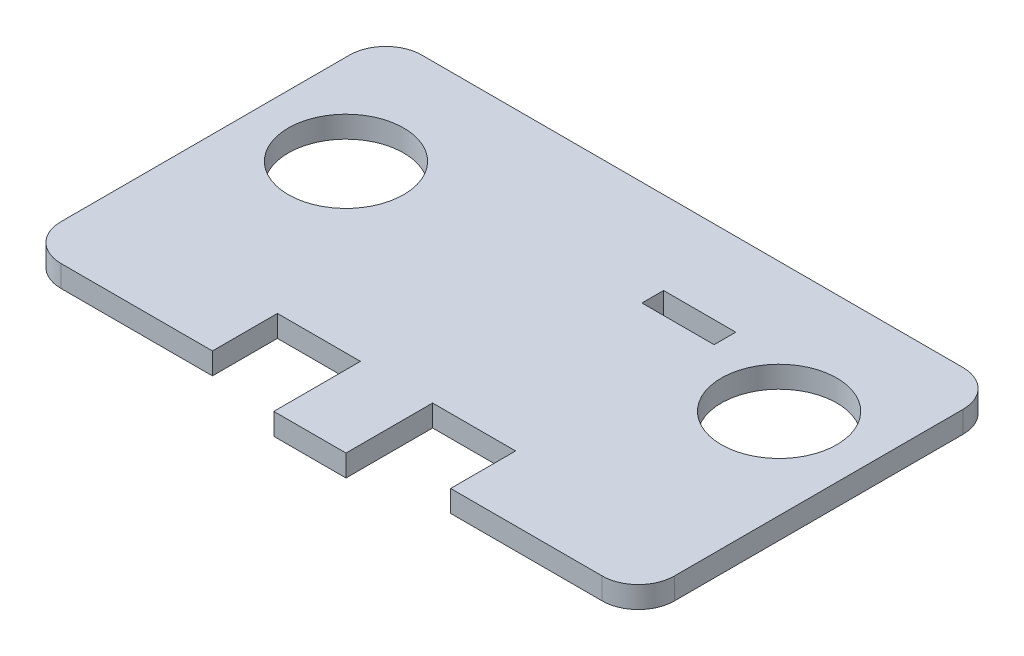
ISO-10303-21;
HEADER;
FILE_DESCRIPTION(('STEP AP214'),'2;1');
FILE_NAME('part.step','',(''),(''),'','','');
FILE_SCHEMA(('AUTOMOTIVE_DESIGN { 1 0 10303 214 1 1 1 1 }'));
ENDSEC;
DATA;
#1=APPLICATION_CONTEXT('core data for automotive mechanical design processes');
#2=APPLICATION_PROTOCOL_DEFINITION('international standard','automotive_design',2000,#1);
#3=PRODUCT_CONTEXT('',#1,'mechanical');
#4=PRODUCT('Part','Part','',(#3));
#5=PRODUCT_RELATED_PRODUCT_CATEGORY('part','',(#4));
#6=PRODUCT_DEFINITION_FORMATION('','',#4);
#7=PRODUCT_DEFINITION_CONTEXT('part definition',#1,'design');
#8=PRODUCT_DEFINITION('design','',#6,#7);
#9=PRODUCT_DEFINITION_SHAPE('','',#8);
#10=(LENGTH_UNIT() NAMED_UNIT(*) SI_UNIT(.MILLI.,.METRE.));
#11=(NAMED_UNIT(*) PLANE_ANGLE_UNIT() SI_UNIT($,.RADIAN.));
#12=(NAMED_UNIT(*) SI_UNIT($,.STERADIAN.) SOLID_ANGLE_UNIT());
#13=UNCERTAINTY_MEASURE_WITH_UNIT(LENGTH_MEASURE(1.E-05),#10,'distance_accuracy_value','');
#14=(GEOMETRIC_REPRESENTATION_CONTEXT(3) GLOBAL_UNCERTAINTY_ASSIGNED_CONTEXT((#13)) GLOBAL_UNIT_ASSIGNED_CONTEXT((#10,
#11,#12)) REPRESENTATION_CONTEXT('',''));
#15=CARTESIAN_POINT('',(0.,0.,0.));
#16=DIRECTION('',(0.,0.,1.));
#17=DIRECTION('',(1.,0.,0.));
#18=AXIS2_PLACEMENT_3D('',#15,#16,#17);
#19=CARTESIAN_POINT('',(0.,0.,16.));
#20=DIRECTION('',(0.,0.,-1.));
#21=DIRECTION('',(-1.,0.,0.));
#22=AXIS2_PLACEMENT_3D('',#19,#20,#21);
#23=PLANE('',#22);
#24=DIRECTION('',(0.,1.,0.));
#25=VECTOR('',#24,1.);
#26=CARTESIAN_POINT('',(5.,0.,16.));
#27=LINE('',#26,#25);
#28=CARTESIAN_POINT('',(5.,0.,16.));
#29=VERTEX_POINT('',#28);
#30=CARTESIAN_POINT('',(5.,3.,16.));
#31=VERTEX_POINT('',#30);
#32=EDGE_CURVE('E230',#29,#31,#27,.T.);
#33=ORIENTED_EDGE('',*,*,#32,.F.);
#34=DIRECTION('',(-1.,0.,0.));
#35=VECTOR('',#34,1.);
#36=CARTESIAN_POINT('',(0.,0.,16.));
#37=LINE('',#36,#35);
#38=CARTESIAN_POINT('',(16.5,0.,16.));
#39=VERTEX_POINT('',#38);
#40=EDGE_CURVE('E244',#39,#29,#37,.T.);
#41=ORIENTED_EDGE('',*,*,#40,.F.);
#42=DIRECTION('',(0.,1.,0.));
#43=VECTOR('',#42,1.);
#44=CARTESIAN_POINT('',(16.5,0.,16.));
#45=LINE('',#44,#43);
#46=CARTESIAN_POINT('',(16.5,3.,16.));
#47=VERTEX_POINT('',#46);
#48=EDGE_CURVE('E239',#39,#47,#45,.T.);
#49=ORIENTED_EDGE('',*,*,#48,.T.);
#50=DIRECTION('',(-1.,0.,0.));
#51=VECTOR('',#50,1.);
#52=CARTESIAN_POINT('',(0.,3.,16.));
#53=LINE('',#52,#51);
#54=EDGE_CURVE('E252',#47,#31,#53,.T.);
#55=ORIENTED_EDGE('',*,*,#54,.T.);
#56=EDGE_LOOP('',(#33,#41,#49,#55));
#57=FACE_BOUND('',#56,.T.);
#58=ADVANCED_FACE('F33',(#57),#23,.F.);
#59=CARTESIAN_POINT('',(-42.5,3.,25.));
#60=DIRECTION('',(0.,0.,-1.));
#61=DIRECTION('',(-1.,0.,0.));
#62=AXIS2_PLACEMENT_3D('',#59,#60,#61);
#63=PLANE('',#62);
#64=DIRECTION('',(0.,1.,0.));
#65=VECTOR('',#64,1.);
#66=CARTESIAN_POINT('',(16.5,0.,25.));
#67=LINE('',#66,#65);
#68=CARTESIAN_POINT('',(16.5,0.,25.));
#69=VERTEX_POINT('',#68);
#70=CARTESIAN_POINT('',(16.5,3.,25.));
#71=VERTEX_POINT('',#70);
#72=EDGE_CURVE('E236',#69,#71,#67,.T.);
#73=ORIENTED_EDGE('',*,*,#72,.F.);
#74=DIRECTION('',(1.,0.,0.));
#75=VECTOR('',#74,1.);
#76=CARTESIAN_POINT('',(-42.5,0.,25.));
#77=LINE('',#76,#75);
#78=CARTESIAN_POINT('',(37.5,0.,25.));
#79=VERTEX_POINT('',#78);
#80=EDGE_CURVE('E297',#69,#79,#77,.T.);
#81=ORIENTED_EDGE('',*,*,#80,.T.);
#82=DIRECTION('',(0.,-1.,0.));
#83=VECTOR('',#82,1.);
#84=CARTESIAN_POINT('',(37.5,3.,25.));
#85=LINE('',#84,#83);
#86=CARTESIAN_POINT('',(37.5,3.,25.));
#87=VERTEX_POINT('',#86);
#88=EDGE_CURVE('E11',#79,#87,#85,.F.);
#89=ORIENTED_EDGE('',*,*,#88,.T.);
#90=DIRECTION('',(1.,0.,0.));
#91=VECTOR('',#90,1.);
#92=CARTESIAN_POINT('',(-42.5,3.,25.));
#93=LINE('',#92,#91);
#94=EDGE_CURVE('E284',#71,#87,#93,.T.);
#95=ORIENTED_EDGE('',*,*,#94,.F.);
#96=EDGE_LOOP('',(#73,#81,#89,#95));
#97=FACE_BOUND('',#96,.T.);
#98=ADVANCED_FACE('F383',(#97),#63,.F.);
#99=CARTESIAN_POINT('',(0.,3.,0.));
#100=DIRECTION('',(0.,1.,0.));
#101=DIRECTION('',(0.,0.,1.));
#102=AXIS2_PLACEMENT_3D('',#99,#100,#101);
#103=PLANE('',#102);
#104=DIRECTION('',(0.,0.,-1.));
#105=VECTOR('',#104,1.);
#106=CARTESIAN_POINT('',(17.5,3.,-13.5));
#107=LINE('',#106,#105);
#108=CARTESIAN_POINT('',(17.5,3.,-10.5));
#109=VERTEX_POINT('',#108);
#110=CARTESIAN_POINT('',(17.5,3.,-13.5));
#111=VERTEX_POINT('',#110);
#112=EDGE_CURVE('E48',#109,#111,#107,.T.);
#113=ORIENTED_EDGE('',*,*,#112,.F.);
#114=DIRECTION('',(1.,0.,0.));
#115=VECTOR('',#114,1.);
#116=CARTESIAN_POINT('',(7.50000000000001,3.,-10.5));
#117=LINE('',#116,#115);
#118=CARTESIAN_POINT('',(7.50000000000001,3.,-10.5));
#119=VERTEX_POINT('',#118);
#120=EDGE_CURVE('E188',#119,#109,#117,.T.);
#121=ORIENTED_EDGE('',*,*,#120,.F.);
#122=DIRECTION('',(0.,0.,1.));
#123=VECTOR('',#122,1.);
#124=CARTESIAN_POINT('',(7.50000000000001,3.,-13.5));
#125=LINE('',#124,#123);
#126=CARTESIAN_POINT('',(7.50000000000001,3.,-13.5));
#127=VERTEX_POINT('',#126);
#128=EDGE_CURVE('E191',#127,#119,#125,.T.);
#129=ORIENTED_EDGE('',*,*,#128,.F.);
#130=DIRECTION('',(-1.,0.,0.));
#131=VECTOR('',#130,1.);
#132=CARTESIAN_POINT('',(7.50000000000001,3.,-13.5));
#133=LINE('',#132,#131);
#134=EDGE_CURVE('E197',#111,#127,#133,.T.);
#135=ORIENTED_EDGE('',*,*,#134,.F.);
#136=EDGE_LOOP('',(#113,#121,#129,#135));
#137=FACE_BOUND('',#136,.T.);
#138=CARTESIAN_POINT('',(-30.,3.,-7.00000000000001));
#139=DIRECTION('',(0.,1.,0.));
#140=DIRECTION('',(0.,0.,1.));
#141=AXIS2_PLACEMENT_3D('',#138,#139,#140);
#142=CIRCLE('',#141,8.);
#143=CARTESIAN_POINT('',(-30.,3.,0.999999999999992));
#144=VERTEX_POINT('',#143);
#145=EDGE_CURVE('E265',#144,#144,#142,.T.);
#146=ORIENTED_EDGE('',*,*,#145,.F.);
#147=EDGE_LOOP('',(#146));
#148=FACE_BOUND('',#147,.T.);
#149=CARTESIAN_POINT('',(30.,3.,-7.00000000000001));
#150=DIRECTION('',(0.,1.,0.));
#151=DIRECTION('',(0.,0.,1.));
#152=AXIS2_PLACEMENT_3D('',#149,#150,#151);
#153=CIRCLE('',#152,8.);
#154=CARTESIAN_POINT('',(30.,3.,0.999999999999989));
#155=VERTEX_POINT('',#154);
#156=EDGE_CURVE('E259',#155,#155,#153,.T.);
#157=ORIENTED_EDGE('',*,*,#156,.F.);
#158=EDGE_LOOP('',(#157));
#159=FACE_BOUND('',#158,.T.);
#160=ORIENTED_EDGE('',*,*,#54,.F.);
#161=DIRECTION('',(0.,0.,1.));
#162=VECTOR('',#161,1.);
#163=CARTESIAN_POINT('',(16.5,3.,25.));
#164=LINE('',#163,#162);
#165=EDGE_CURVE('E233',#47,#71,#164,.T.);
#166=ORIENTED_EDGE('',*,*,#165,.T.);
#167=ORIENTED_EDGE('',*,*,#94,.T.);
#168=CARTESIAN_POINT('',(37.5,3.,20.));
#169=DIRECTION('',(0.,1.,0.));
#170=DIRECTION('',(0.,0.,1.));
#171=AXIS2_PLACEMENT_3D('',#168,#169,#170);
#172=CIRCLE('',#171,5.);
#173=CARTESIAN_POINT('',(42.5,3.,20.));
#174=VERTEX_POINT('',#173);
#175=EDGE_CURVE('E320',#87,#174,#172,.T.);
#176=ORIENTED_EDGE('',*,*,#175,.T.);
#177=DIRECTION('',(0.,0.,-1.));
#178=VECTOR('',#177,1.);
#179=CARTESIAN_POINT('',(42.5,3.,-25.));
#180=LINE('',#179,#178);
#181=CARTESIAN_POINT('',(42.5,3.,-20.));
#182=VERTEX_POINT('',#181);
#183=EDGE_CURVE('E274',#174,#182,#180,.T.);
#184=ORIENTED_EDGE('',*,*,#183,.T.);
#185=CARTESIAN_POINT('',(37.5,3.,-20.));
#186=DIRECTION('',(0.,1.,0.));
#187=DIRECTION('',(0.,0.,1.));
#188=AXIS2_PLACEMENT_3D('',#185,#186,#187);
#189=CIRCLE('',#188,5.);
#190=CARTESIAN_POINT('',(37.5,3.,-25.));
#191=VERTEX_POINT('',#190);
#192=EDGE_CURVE('E322',#182,#191,#189,.T.);
#193=ORIENTED_EDGE('',*,*,#192,.T.);
#194=DIRECTION('',(-1.,0.,0.));
#195=VECTOR('',#194,1.);
#196=CARTESIAN_POINT('',(-42.5,3.,-25.));
#197=LINE('',#196,#195);
#198=CARTESIAN_POINT('',(-37.5,3.,-25.));
#199=VERTEX_POINT('',#198);
#200=EDGE_CURVE('E277',#191,#199,#197,.T.);
#201=ORIENTED_EDGE('',*,*,#200,.T.);
#202=CARTESIAN_POINT('',(-37.5,3.,-20.));
#203=DIRECTION('',(0.,1.,0.));
#204=DIRECTION('',(0.,0.,1.));
#205=AXIS2_PLACEMENT_3D('',#202,#203,#204);
#206=CIRCLE('',#205,5.);
#207=CARTESIAN_POINT('',(-42.5,3.,-20.));
#208=VERTEX_POINT('',#207);
#209=EDGE_CURVE('E324',#199,#208,#206,.T.);
#210=ORIENTED_EDGE('',*,*,#209,.T.);
#211=DIRECTION('',(0.,0.,1.));
#212=VECTOR('',#211,1.);
#213=CARTESIAN_POINT('',(-42.5,3.,-25.));
#214=LINE('',#213,#212);
#215=CARTESIAN_POINT('',(-42.5,3.,20.));
#216=VERTEX_POINT('',#215);
#217=EDGE_CURVE('E281',#208,#216,#214,.T.);
#218=ORIENTED_EDGE('',*,*,#217,.T.);
#219=CARTESIAN_POINT('',(-37.5,3.,20.));
#220=DIRECTION('',(0.,1.,0.));
#221=DIRECTION('',(0.,0.,1.));
#222=AXIS2_PLACEMENT_3D('',#219,#220,#221);
#223=CIRCLE('',#222,5.);
#224=CARTESIAN_POINT('',(-37.5,3.,25.));
#225=VERTEX_POINT('',#224);
#226=EDGE_CURVE('E318',#216,#225,#223,.T.);
#227=ORIENTED_EDGE('',*,*,#226,.T.);
#228=CARTESIAN_POINT('',(-16.5,3.,25.));
#229=VERTEX_POINT('',#228);
#230=EDGE_CURVE('E285',#225,#229,#93,.T.);
#231=ORIENTED_EDGE('',*,*,#230,.T.);
#232=DIRECTION('',(0.,0.,1.));
#233=VECTOR('',#232,1.);
#234=CARTESIAN_POINT('',(-16.5,3.,25.));
#235=LINE('',#234,#233);
#236=CARTESIAN_POINT('',(-16.5,3.,16.));
#237=VERTEX_POINT('',#236);
#238=EDGE_CURVE('E254',#237,#229,#235,.T.);
#239=ORIENTED_EDGE('',*,*,#238,.F.);
#240=CARTESIAN_POINT('',(-5.,3.,16.));
#241=VERTEX_POINT('',#240);
#242=EDGE_CURVE('E242',#241,#237,#53,.T.);
#243=ORIENTED_EDGE('',*,*,#242,.F.);
#244=DIRECTION('',(0.,0.,1.));
#245=VECTOR('',#244,1.);
#246=CARTESIAN_POINT('',(-5.,3.,16.));
#247=LINE('',#246,#245);
#248=CARTESIAN_POINT('',(-5.,3.,28.));
#249=VERTEX_POINT('',#248);
#250=EDGE_CURVE('E210',#241,#249,#247,.T.);
#251=ORIENTED_EDGE('',*,*,#250,.T.);
#252=DIRECTION('',(1.,0.,0.));
#253=VECTOR('',#252,1.);
#254=CARTESIAN_POINT('',(-5.,3.,28.));
#255=LINE('',#254,#253);
#256=CARTESIAN_POINT('',(5.,3.,28.));
#257=VERTEX_POINT('',#256);
#258=EDGE_CURVE('E219',#249,#257,#255,.T.);
#259=ORIENTED_EDGE('',*,*,#258,.T.);
#260=DIRECTION('',(0.,0.,1.));
#261=VECTOR('',#260,1.);
#262=CARTESIAN_POINT('',(5.,3.,16.));
#263=LINE('',#262,#261);
#264=EDGE_CURVE('E203',#31,#257,#263,.T.);
#265=ORIENTED_EDGE('',*,*,#264,.F.);
#266=EDGE_LOOP('',(#160,#166,#167,#176,#184,#193,#201,#210,#218,#227,#231,#239,#243,#251,#259,#265));
#267=FACE_BOUND('',#266,.T.);
#268=ADVANCED_FACE('F352',(#137,#148,#159,#267),#103,.T.);
#269=CARTESIAN_POINT('',(0.,0.,0.));
#270=DIRECTION('',(0.,1.,0.));
#271=DIRECTION('',(0.,0.,1.));
#272=AXIS2_PLACEMENT_3D('',#269,#270,#271);
#273=PLANE('',#272);
#274=DIRECTION('',(1.,0.,0.));
#275=VECTOR('',#274,1.);
#276=CARTESIAN_POINT('',(7.50000000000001,0.,-10.5));
#277=LINE('',#276,#275);
#278=CARTESIAN_POINT('',(7.50000000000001,0.,-10.5));
#279=VERTEX_POINT('',#278);
#280=CARTESIAN_POINT('',(17.5,0.,-10.5));
#281=VERTEX_POINT('',#280);
#282=EDGE_CURVE('E178',#279,#281,#277,.T.);
#283=ORIENTED_EDGE('',*,*,#282,.T.);
#284=DIRECTION('',(0.,0.,-1.));
#285=VECTOR('',#284,1.);
#286=CARTESIAN_POINT('',(17.5,0.,-13.5));
#287=LINE('',#286,#285);
#288=CARTESIAN_POINT('',(17.5,0.,-13.5));
#289=VERTEX_POINT('',#288);
#290=EDGE_CURVE('E172',#281,#289,#287,.T.);
#291=ORIENTED_EDGE('',*,*,#290,.T.);
#292=DIRECTION('',(-1.,0.,0.));
#293=VECTOR('',#292,1.);
#294=CARTESIAN_POINT('',(7.50000000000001,0.,-13.5));
#295=LINE('',#294,#293);
#296=CARTESIAN_POINT('',(7.50000000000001,0.,-13.5));
#297=VERTEX_POINT('',#296);
#298=EDGE_CURVE('E181',#289,#297,#295,.T.);
#299=ORIENTED_EDGE('',*,*,#298,.T.);
#300=DIRECTION('',(0.,0.,1.));
#301=VECTOR('',#300,1.);
#302=CARTESIAN_POINT('',(7.50000000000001,0.,-13.5));
#303=LINE('',#302,#301);
#304=EDGE_CURVE('E56',#297,#279,#303,.T.);
#305=ORIENTED_EDGE('',*,*,#304,.T.);
#306=EDGE_LOOP('',(#283,#291,#299,#305));
#307=FACE_BOUND('',#306,.T.);
#308=CARTESIAN_POINT('',(-30.,0.,-7.00000000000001));
#309=DIRECTION('',(0.,1.,0.));
#310=DIRECTION('',(0.,0.,1.));
#311=AXIS2_PLACEMENT_3D('',#308,#309,#310);
#312=CIRCLE('',#311,8.);
#313=CARTESIAN_POINT('',(-30.,0.,0.999999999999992));
#314=VERTEX_POINT('',#313);
#315=EDGE_CURVE('E268',#314,#314,#312,.T.);
#316=ORIENTED_EDGE('',*,*,#315,.T.);
#317=EDGE_LOOP('',(#316));
#318=FACE_BOUND('',#317,.T.);
#319=CARTESIAN_POINT('',(30.,0.,-7.00000000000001));
#320=DIRECTION('',(0.,1.,0.));
#321=DIRECTION('',(0.,0.,1.));
#322=AXIS2_PLACEMENT_3D('',#319,#320,#321);
#323=CIRCLE('',#322,8.);
#324=CARTESIAN_POINT('',(30.,0.,0.999999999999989));
#325=VERTEX_POINT('',#324);
#326=EDGE_CURVE('E262',#325,#325,#323,.T.);
#327=ORIENTED_EDGE('',*,*,#326,.T.);
#328=EDGE_LOOP('',(#327));
#329=FACE_BOUND('',#328,.T.);
#330=DIRECTION('',(0.,0.,1.));
#331=VECTOR('',#330,1.);
#332=CARTESIAN_POINT('',(16.5,0.,25.));
#333=LINE('',#332,#331);
#334=EDGE_CURVE('E234',#39,#69,#333,.T.);
#335=ORIENTED_EDGE('',*,*,#334,.F.);
#336=ORIENTED_EDGE('',*,*,#40,.T.);
#337=DIRECTION('',(0.,0.,1.));
#338=VECTOR('',#337,1.);
#339=CARTESIAN_POINT('',(5.,0.,16.));
#340=LINE('',#339,#338);
#341=CARTESIAN_POINT('',(5.,0.,28.));
#342=VERTEX_POINT('',#341);
#343=EDGE_CURVE('E207',#29,#342,#340,.T.);
#344=ORIENTED_EDGE('',*,*,#343,.T.);
#345=DIRECTION('',(1.,0.,0.));
#346=VECTOR('',#345,1.);
#347=CARTESIAN_POINT('',(-5.,0.,28.));
#348=LINE('',#347,#346);
#349=CARTESIAN_POINT('',(-5.,0.,28.));
#350=VERTEX_POINT('',#349);
#351=EDGE_CURVE('E209',#350,#342,#348,.T.);
#352=ORIENTED_EDGE('',*,*,#351,.F.);
#353=DIRECTION('',(0.,0.,1.));
#354=VECTOR('',#353,1.);
#355=CARTESIAN_POINT('',(-5.,0.,16.));
#356=LINE('',#355,#354);
#357=CARTESIAN_POINT('',(-5.,0.,16.));
#358=VERTEX_POINT('',#357);
#359=EDGE_CURVE('E213',#358,#350,#356,.T.);
#360=ORIENTED_EDGE('',*,*,#359,.F.);
#361=CARTESIAN_POINT('',(-16.5,0.,16.));
#362=VERTEX_POINT('',#361);
#363=EDGE_CURVE('E248',#358,#362,#37,.T.);
#364=ORIENTED_EDGE('',*,*,#363,.T.);
#365=DIRECTION('',(0.,0.,1.));
#366=VECTOR('',#365,1.);
#367=CARTESIAN_POINT('',(-16.5,0.,25.));
#368=LINE('',#367,#366);
#369=CARTESIAN_POINT('',(-16.5,0.,25.));
#370=VERTEX_POINT('',#369);
#371=EDGE_CURVE('E247',#362,#370,#368,.T.);
#372=ORIENTED_EDGE('',*,*,#371,.T.);
#373=CARTESIAN_POINT('',(-37.5,0.,25.));
#374=VERTEX_POINT('',#373);
#375=EDGE_CURVE('E278',#374,#370,#77,.T.);
#376=ORIENTED_EDGE('',*,*,#375,.F.);
#377=CARTESIAN_POINT('',(-37.5,0.,20.));
#378=DIRECTION('',(0.,1.,0.));
#379=DIRECTION('',(0.,0.,1.));
#380=AXIS2_PLACEMENT_3D('',#377,#378,#379);
#381=CIRCLE('',#380,5.);
#382=CARTESIAN_POINT('',(-42.5,0.,20.));
#383=VERTEX_POINT('',#382);
#384=EDGE_CURVE('E304',#374,#383,#381,.F.);
#385=ORIENTED_EDGE('',*,*,#384,.T.);
#386=DIRECTION('',(0.,0.,1.));
#387=VECTOR('',#386,1.);
#388=CARTESIAN_POINT('',(-42.5,0.,-25.));
#389=LINE('',#388,#387);
#390=CARTESIAN_POINT('',(-42.5,0.,-20.));
#391=VERTEX_POINT('',#390);
#392=EDGE_CURVE('E294',#391,#383,#389,.T.);
#393=ORIENTED_EDGE('',*,*,#392,.F.);
#394=CARTESIAN_POINT('',(-37.5,0.,-20.));
#395=DIRECTION('',(0.,1.,0.));
#396=DIRECTION('',(0.,0.,1.));
#397=AXIS2_PLACEMENT_3D('',#394,#395,#396);
#398=CIRCLE('',#397,5.);
#399=CARTESIAN_POINT('',(-37.5,0.,-25.));
#400=VERTEX_POINT('',#399);
#401=EDGE_CURVE('E311',#391,#400,#398,.F.);
#402=ORIENTED_EDGE('',*,*,#401,.T.);
#403=DIRECTION('',(-1.,0.,0.));
#404=VECTOR('',#403,1.);
#405=CARTESIAN_POINT('',(-42.5,0.,-25.));
#406=LINE('',#405,#404);
#407=CARTESIAN_POINT('',(37.5,0.,-25.));
#408=VERTEX_POINT('',#407);
#409=EDGE_CURVE('E291',#408,#400,#406,.T.);
#410=ORIENTED_EDGE('',*,*,#409,.F.);
#411=CARTESIAN_POINT('',(37.5,0.,-20.));
#412=DIRECTION('',(0.,1.,0.));
#413=DIRECTION('',(0.,0.,1.));
#414=AXIS2_PLACEMENT_3D('',#411,#412,#413);
#415=CIRCLE('',#414,5.);
#416=CARTESIAN_POINT('',(42.5,0.,-20.));
#417=VERTEX_POINT('',#416);
#418=EDGE_CURVE('E309',#408,#417,#415,.F.);
#419=ORIENTED_EDGE('',*,*,#418,.T.);
#420=DIRECTION('',(0.,0.,-1.));
#421=VECTOR('',#420,1.);
#422=CARTESIAN_POINT('',(42.5,0.,-25.));
#423=LINE('',#422,#421);
#424=CARTESIAN_POINT('',(42.5,0.,20.));
#425=VERTEX_POINT('',#424);
#426=EDGE_CURVE('E271',#425,#417,#423,.T.);
#427=ORIENTED_EDGE('',*,*,#426,.F.);
#428=CARTESIAN_POINT('',(37.5,0.,20.));
#429=DIRECTION('',(0.,1.,0.));
#430=DIRECTION('',(0.,0.,1.));
#431=AXIS2_PLACEMENT_3D('',#428,#429,#430);
#432=CIRCLE('',#431,5.);
#433=EDGE_CURVE('E306',#425,#79,#432,.F.);
#434=ORIENTED_EDGE('',*,*,#433,.T.);
#435=ORIENTED_EDGE('',*,*,#80,.F.);
#436=EDGE_LOOP('',(#335,#336,#344,#352,#360,#364,#372,#376,#385,#393,#402,#410,#419,#427,#434,#435));
#437=FACE_BOUND('',#436,.T.);
#438=ADVANCED_FACE('F185',(#307,#318,#329,#437),#273,.F.);
#439=CARTESIAN_POINT('',(42.5,3.,-25.));
#440=DIRECTION('',(-1.,0.,0.));
#441=DIRECTION('',(0.,0.,1.));
#442=AXIS2_PLACEMENT_3D('',#439,#440,#441);
#443=PLANE('',#442);
#444=ORIENTED_EDGE('',*,*,#426,.T.);
#445=DIRECTION('',(0.,-1.,0.));
#446=VECTOR('',#445,1.);
#447=CARTESIAN_POINT('',(42.5,3.,-20.));
#448=LINE('',#447,#446);
#449=EDGE_CURVE('E329',#417,#182,#448,.F.);
#450=ORIENTED_EDGE('',*,*,#449,.T.);
#451=ORIENTED_EDGE('',*,*,#183,.F.);
#452=DIRECTION('',(0.,-1.,0.));
#453=VECTOR('',#452,1.);
#454=CARTESIAN_POINT('',(42.5,3.,20.));
#455=LINE('',#454,#453);
#456=EDGE_CURVE('E326',#174,#425,#455,.T.);
#457=ORIENTED_EDGE('',*,*,#456,.T.);
#458=EDGE_LOOP('',(#444,#450,#451,#457));
#459=FACE_BOUND('',#458,.T.);
#460=ADVANCED_FACE('F373',(#459),#443,.F.);
#461=CARTESIAN_POINT('',(-42.5,3.,-25.));
#462=DIRECTION('',(0.,0.,1.));
#463=DIRECTION('',(1.,0.,0.));
#464=AXIS2_PLACEMENT_3D('',#461,#462,#463);
#465=PLANE('',#464);
#466=ORIENTED_EDGE('',*,*,#409,.T.);
#467=DIRECTION('',(0.,-1.,0.));
#468=VECTOR('',#467,1.);
#469=CARTESIAN_POINT('',(-37.5,3.,-25.));
#470=LINE('',#469,#468);
#471=EDGE_CURVE('E316',#400,#199,#470,.F.);
#472=ORIENTED_EDGE('',*,*,#471,.T.);
#473=ORIENTED_EDGE('',*,*,#200,.F.);
#474=DIRECTION('',(0.,-1.,0.));
#475=VECTOR('',#474,1.);
#476=CARTESIAN_POINT('',(37.5,3.,-25.));
#477=LINE('',#476,#475);
#478=EDGE_CURVE('E313',#191,#408,#477,.T.);
#479=ORIENTED_EDGE('',*,*,#478,.T.);
#480=EDGE_LOOP('',(#466,#472,#473,#479));
#481=FACE_BOUND('',#480,.T.);
#482=ADVANCED_FACE('F362',(#481),#465,.F.);
#483=CARTESIAN_POINT('',(-42.5,3.,-25.));
#484=DIRECTION('',(1.,0.,0.));
#485=DIRECTION('',(0.,0.,-1.));
#486=AXIS2_PLACEMENT_3D('',#483,#484,#485);
#487=PLANE('',#486);
#488=ORIENTED_EDGE('',*,*,#217,.F.);
#489=DIRECTION('',(0.,-1.,0.));
#490=VECTOR('',#489,1.);
#491=CARTESIAN_POINT('',(-42.5,3.,-20.));
#492=LINE('',#491,#490);
#493=EDGE_CURVE('E301',#208,#391,#492,.T.);
#494=ORIENTED_EDGE('',*,*,#493,.T.);
#495=ORIENTED_EDGE('',*,*,#392,.T.);
#496=DIRECTION('',(0.,-1.,0.));
#497=VECTOR('',#496,1.);
#498=CARTESIAN_POINT('',(-42.5,3.,20.));
#499=LINE('',#498,#497);
#500=EDGE_CURVE('E288',#383,#216,#499,.F.);
#501=ORIENTED_EDGE('',*,*,#500,.T.);
#502=EDGE_LOOP('',(#488,#494,#495,#501));
#503=FACE_BOUND('',#502,.T.);
#504=ADVANCED_FACE('F356',(#503),#487,.F.);
#505=ORIENTED_EDGE('',*,*,#375,.T.);
#506=DIRECTION('',(0.,1.,0.));
#507=VECTOR('',#506,1.);
#508=CARTESIAN_POINT('',(-16.5,0.,25.));
#509=LINE('',#508,#507);
#510=EDGE_CURVE('E256',#370,#229,#509,.T.);
#511=ORIENTED_EDGE('',*,*,#510,.T.);
#512=ORIENTED_EDGE('',*,*,#230,.F.);
#513=DIRECTION('',(0.,-1.,0.));
#514=VECTOR('',#513,1.);
#515=CARTESIAN_POINT('',(-37.5,3.,25.));
#516=LINE('',#515,#514);
#517=EDGE_CURVE('E41',#225,#374,#516,.T.);
#518=ORIENTED_EDGE('',*,*,#517,.T.);
#519=EDGE_LOOP('',(#505,#511,#512,#518));
#520=FACE_BOUND('',#519,.T.);
#521=ADVANCED_FACE('F335',(#520),#63,.F.);
#522=CARTESIAN_POINT('',(-37.5,3.,-20.));
#523=DIRECTION('',(0.,-1.,0.));
#524=DIRECTION('',(0.,0.,-1.));
#525=AXIS2_PLACEMENT_3D('',#522,#523,#524);
#526=CYLINDRICAL_SURFACE('',#525,5.);
#527=ORIENTED_EDGE('',*,*,#209,.F.);
#528=ORIENTED_EDGE('',*,*,#471,.F.);
#529=ORIENTED_EDGE('',*,*,#401,.F.);
#530=ORIENTED_EDGE('',*,*,#493,.F.);
#531=EDGE_LOOP('',(#527,#528,#529,#530));
#532=FACE_BOUND('',#531,.T.);
#533=ADVANCED_FACE('F366',(#532),#526,.T.);
#534=CARTESIAN_POINT('',(37.5,3.,-20.));
#535=DIRECTION('',(0.,-1.,0.));
#536=DIRECTION('',(0.,0.,-1.));
#537=AXIS2_PLACEMENT_3D('',#534,#535,#536);
#538=CYLINDRICAL_SURFACE('',#537,5.);
#539=ORIENTED_EDGE('',*,*,#192,.F.);
#540=ORIENTED_EDGE('',*,*,#449,.F.);
#541=ORIENTED_EDGE('',*,*,#418,.F.);
#542=ORIENTED_EDGE('',*,*,#478,.F.);
#543=EDGE_LOOP('',(#539,#540,#541,#542));
#544=FACE_BOUND('',#543,.T.);
#545=ADVANCED_FACE('F369',(#544),#538,.T.);
#546=CARTESIAN_POINT('',(37.5,3.,20.));
#547=DIRECTION('',(0.,-1.,0.));
#548=DIRECTION('',(0.,0.,-1.));
#549=AXIS2_PLACEMENT_3D('',#546,#547,#548);
#550=CYLINDRICAL_SURFACE('',#549,5.);
#551=ORIENTED_EDGE('',*,*,#175,.F.);
#552=ORIENTED_EDGE('',*,*,#88,.F.);
#553=ORIENTED_EDGE('',*,*,#433,.F.);
#554=ORIENTED_EDGE('',*,*,#456,.F.);
#555=EDGE_LOOP('',(#551,#552,#553,#554));
#556=FACE_BOUND('',#555,.T.);
#557=ADVANCED_FACE('F378',(#556),#550,.T.);
#558=CARTESIAN_POINT('',(-37.5,3.,20.));
#559=DIRECTION('',(0.,-1.,0.));
#560=DIRECTION('',(0.,0.,-1.));
#561=AXIS2_PLACEMENT_3D('',#558,#559,#560);
#562=CYLINDRICAL_SURFACE('',#561,5.);
#563=ORIENTED_EDGE('',*,*,#226,.F.);
#564=ORIENTED_EDGE('',*,*,#500,.F.);
#565=ORIENTED_EDGE('',*,*,#384,.F.);
#566=ORIENTED_EDGE('',*,*,#517,.F.);
#567=EDGE_LOOP('',(#563,#564,#565,#566));
#568=FACE_BOUND('',#567,.T.);
#569=ADVANCED_FACE('F35',(#568),#562,.T.);
#570=CARTESIAN_POINT('',(-30.,0.,-7.00000000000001));
#571=DIRECTION('',(0.,1.,0.));
#572=DIRECTION('',(0.,0.,1.));
#573=AXIS2_PLACEMENT_3D('',#570,#571,#572);
#574=CYLINDRICAL_SURFACE('',#573,8.);
#575=ORIENTED_EDGE('',*,*,#315,.F.);
#576=EDGE_LOOP('',(#575));
#577=FACE_BOUND('',#576,.T.);
#578=ORIENTED_EDGE('',*,*,#145,.T.);
#579=EDGE_LOOP('',(#578));
#580=FACE_BOUND('',#579,.T.);
#581=ADVANCED_FACE('F428',(#577,#580),#574,.F.);
#582=CARTESIAN_POINT('',(30.,0.,-7.00000000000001));
#583=DIRECTION('',(0.,1.,0.));
#584=DIRECTION('',(0.,0.,1.));
#585=AXIS2_PLACEMENT_3D('',#582,#583,#584);
#586=CYLINDRICAL_SURFACE('',#585,8.);
#587=ORIENTED_EDGE('',*,*,#326,.F.);
#588=EDGE_LOOP('',(#587));
#589=FACE_BOUND('',#588,.T.);
#590=ORIENTED_EDGE('',*,*,#156,.T.);
#591=EDGE_LOOP('',(#590));
#592=FACE_BOUND('',#591,.T.);
#593=ADVANCED_FACE('F424',(#589,#592),#586,.F.);
#594=CARTESIAN_POINT('',(-16.5,0.,25.));
#595=DIRECTION('',(-1.,0.,0.));
#596=DIRECTION('',(0.,0.,1.));
#597=AXIS2_PLACEMENT_3D('',#594,#595,#596);
#598=PLANE('',#597);
#599=ORIENTED_EDGE('',*,*,#238,.T.);
#600=ORIENTED_EDGE('',*,*,#510,.F.);
#601=ORIENTED_EDGE('',*,*,#371,.F.);
#602=DIRECTION('',(0.,1.,0.));
#603=VECTOR('',#602,1.);
#604=CARTESIAN_POINT('',(-16.5,0.,16.));
#605=LINE('',#604,#603);
#606=EDGE_CURVE('E251',#362,#237,#605,.T.);
#607=ORIENTED_EDGE('',*,*,#606,.T.);
#608=EDGE_LOOP('',(#599,#600,#601,#607));
#609=FACE_BOUND('',#608,.T.);
#610=ADVANCED_FACE('F345',(#609),#598,.F.);
#611=ORIENTED_EDGE('',*,*,#363,.F.);
#612=DIRECTION('',(0.,1.,0.));
#613=VECTOR('',#612,1.);
#614=CARTESIAN_POINT('',(-5.,0.,16.));
#615=LINE('',#614,#613);
#616=EDGE_CURVE('E216',#358,#241,#615,.T.);
#617=ORIENTED_EDGE('',*,*,#616,.T.);
#618=ORIENTED_EDGE('',*,*,#242,.T.);
#619=ORIENTED_EDGE('',*,*,#606,.F.);
#620=EDGE_LOOP('',(#611,#617,#618,#619));
#621=FACE_BOUND('',#620,.T.);
#622=ADVANCED_FACE('F348',(#621),#23,.F.);
#623=CARTESIAN_POINT('',(16.5,0.,25.));
#624=DIRECTION('',(-1.,0.,0.));
#625=DIRECTION('',(0.,0.,1.));
#626=AXIS2_PLACEMENT_3D('',#623,#624,#625);
#627=PLANE('',#626);
#628=ORIENTED_EDGE('',*,*,#165,.F.);
#629=ORIENTED_EDGE('',*,*,#48,.F.);
#630=ORIENTED_EDGE('',*,*,#334,.T.);
#631=ORIENTED_EDGE('',*,*,#72,.T.);
#632=EDGE_LOOP('',(#628,#629,#630,#631));
#633=FACE_BOUND('',#632,.T.);
#634=ADVANCED_FACE('F387',(#633),#627,.T.);
#635=CARTESIAN_POINT('',(5.,0.,16.));
#636=DIRECTION('',(-1.,0.,0.));
#637=DIRECTION('',(0.,0.,1.));
#638=AXIS2_PLACEMENT_3D('',#635,#636,#637);
#639=PLANE('',#638);
#640=ORIENTED_EDGE('',*,*,#264,.T.);
#641=DIRECTION('',(0.,1.,0.));
#642=VECTOR('',#641,1.);
#643=CARTESIAN_POINT('',(5.,0.,28.));
#644=LINE('',#643,#642);
#645=EDGE_CURVE('E228',#342,#257,#644,.T.);
#646=ORIENTED_EDGE('',*,*,#645,.F.);
#647=ORIENTED_EDGE('',*,*,#343,.F.);
#648=ORIENTED_EDGE('',*,*,#32,.T.);
#649=EDGE_LOOP('',(#640,#646,#647,#648));
#650=FACE_BOUND('',#649,.T.);
#651=ADVANCED_FACE('F395',(#650),#639,.F.);
#652=CARTESIAN_POINT('',(-5.,0.,28.));
#653=DIRECTION('',(0.,0.,1.));
#654=DIRECTION('',(1.,0.,0.));
#655=AXIS2_PLACEMENT_3D('',#652,#653,#654);
#656=PLANE('',#655);
#657=ORIENTED_EDGE('',*,*,#258,.F.);
#658=DIRECTION('',(0.,1.,0.));
#659=VECTOR('',#658,1.);
#660=CARTESIAN_POINT('',(-5.,0.,28.));
#661=LINE('',#660,#659);
#662=EDGE_CURVE('E226',#350,#249,#661,.T.);
#663=ORIENTED_EDGE('',*,*,#662,.F.);
#664=ORIENTED_EDGE('',*,*,#351,.T.);
#665=ORIENTED_EDGE('',*,*,#645,.T.);
#666=EDGE_LOOP('',(#657,#663,#664,#665));
#667=FACE_BOUND('',#666,.T.);
#668=ADVANCED_FACE('F398',(#667),#656,.T.);
#669=CARTESIAN_POINT('',(-5.,0.,16.));
#670=DIRECTION('',(-1.,0.,0.));
#671=DIRECTION('',(0.,0.,1.));
#672=AXIS2_PLACEMENT_3D('',#669,#670,#671);
#673=PLANE('',#672);
#674=ORIENTED_EDGE('',*,*,#250,.F.);
#675=ORIENTED_EDGE('',*,*,#616,.F.);
#676=ORIENTED_EDGE('',*,*,#359,.T.);
#677=ORIENTED_EDGE('',*,*,#662,.T.);
#678=EDGE_LOOP('',(#674,#675,#676,#677));
#679=FACE_BOUND('',#678,.T.);
#680=ADVANCED_FACE('F400',(#679),#673,.T.);
#681=CARTESIAN_POINT('',(17.5,0.,-13.5));
#682=DIRECTION('',(1.,0.,0.));
#683=DIRECTION('',(0.,0.,-1.));
#684=AXIS2_PLACEMENT_3D('',#681,#682,#683);
#685=PLANE('',#684);
#686=ORIENTED_EDGE('',*,*,#112,.T.);
#687=DIRECTION('',(0.,1.,0.));
#688=VECTOR('',#687,1.);
#689=CARTESIAN_POINT('',(17.5,0.,-13.5));
#690=LINE('',#689,#688);
#691=EDGE_CURVE('E168',#289,#111,#690,.T.);
#692=ORIENTED_EDGE('',*,*,#691,.F.);
#693=ORIENTED_EDGE('',*,*,#290,.F.);
#694=DIRECTION('',(0.,1.,0.));
#695=VECTOR('',#694,1.);
#696=CARTESIAN_POINT('',(17.5,0.,-10.5));
#697=LINE('',#696,#695);
#698=EDGE_CURVE('E201',#281,#109,#697,.T.);
#699=ORIENTED_EDGE('',*,*,#698,.T.);
#700=EDGE_LOOP('',(#686,#692,#693,#699));
#701=FACE_BOUND('',#700,.T.);
#702=ADVANCED_FACE('F170',(#701),#685,.F.);
#703=CARTESIAN_POINT('',(7.50000000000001,0.,-10.5));
#704=DIRECTION('',(0.,0.,1.));
#705=DIRECTION('',(1.,0.,0.));
#706=AXIS2_PLACEMENT_3D('',#703,#704,#705);
#707=PLANE('',#706);
#708=ORIENTED_EDGE('',*,*,#120,.T.);
#709=ORIENTED_EDGE('',*,*,#698,.F.);
#710=ORIENTED_EDGE('',*,*,#282,.F.);
#711=DIRECTION('',(0.,1.,0.));
#712=VECTOR('',#711,1.);
#713=CARTESIAN_POINT('',(7.50000000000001,0.,-10.5));
#714=LINE('',#713,#712);
#715=EDGE_CURVE('E204',#279,#119,#714,.T.);
#716=ORIENTED_EDGE('',*,*,#715,.T.);
#717=EDGE_LOOP('',(#708,#709,#710,#716));
#718=FACE_BOUND('',#717,.T.);
#719=ADVANCED_FACE('F407',(#718),#707,.F.);
#720=CARTESIAN_POINT('',(7.50000000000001,0.,-13.5));
#721=DIRECTION('',(-1.,0.,0.));
#722=DIRECTION('',(0.,0.,1.));
#723=AXIS2_PLACEMENT_3D('',#720,#721,#722);
#724=PLANE('',#723);
#725=ORIENTED_EDGE('',*,*,#128,.T.);
#726=ORIENTED_EDGE('',*,*,#715,.F.);
#727=ORIENTED_EDGE('',*,*,#304,.F.);
#728=DIRECTION('',(0.,1.,0.));
#729=VECTOR('',#728,1.);
#730=CARTESIAN_POINT('',(7.50000000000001,0.,-13.5));
#731=LINE('',#730,#729);
#732=EDGE_CURVE('E177',#297,#127,#731,.T.);
#733=ORIENTED_EDGE('',*,*,#732,.T.);
#734=EDGE_LOOP('',(#725,#726,#727,#733));
#735=FACE_BOUND('',#734,.T.);
#736=ADVANCED_FACE('F480',(#735),#724,.F.);
#737=CARTESIAN_POINT('',(7.50000000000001,0.,-13.5));
#738=DIRECTION('',(0.,0.,-1.));
#739=DIRECTION('',(-1.,0.,0.));
#740=AXIS2_PLACEMENT_3D('',#737,#738,#739);
#741=PLANE('',#740);
#742=ORIENTED_EDGE('',*,*,#134,.T.);
#743=ORIENTED_EDGE('',*,*,#732,.F.);
#744=ORIENTED_EDGE('',*,*,#298,.F.);
#745=ORIENTED_EDGE('',*,*,#691,.T.);
#746=EDGE_LOOP('',(#742,#743,#744,#745));
#747=FACE_BOUND('',#746,.T.);
#748=ADVANCED_FACE('F182',(#747),#741,.F.);
#749=CLOSED_SHELL('',(#58,#98,#268,#438,#460,#482,#504,#521,#533,#545,#557,#569,#581,#593,#610,
#622,#634,#651,#668,#680,#702,#719,#736,#748));
#750=MANIFOLD_SOLID_BREP('B2',#749);
#751=ADVANCED_BREP_SHAPE_REPRESENTATION('',(#18,#750),#14);
#752=SHAPE_DEFINITION_REPRESENTATION(#9,#751);
ENDSEC;
END-ISO-10303-21;
